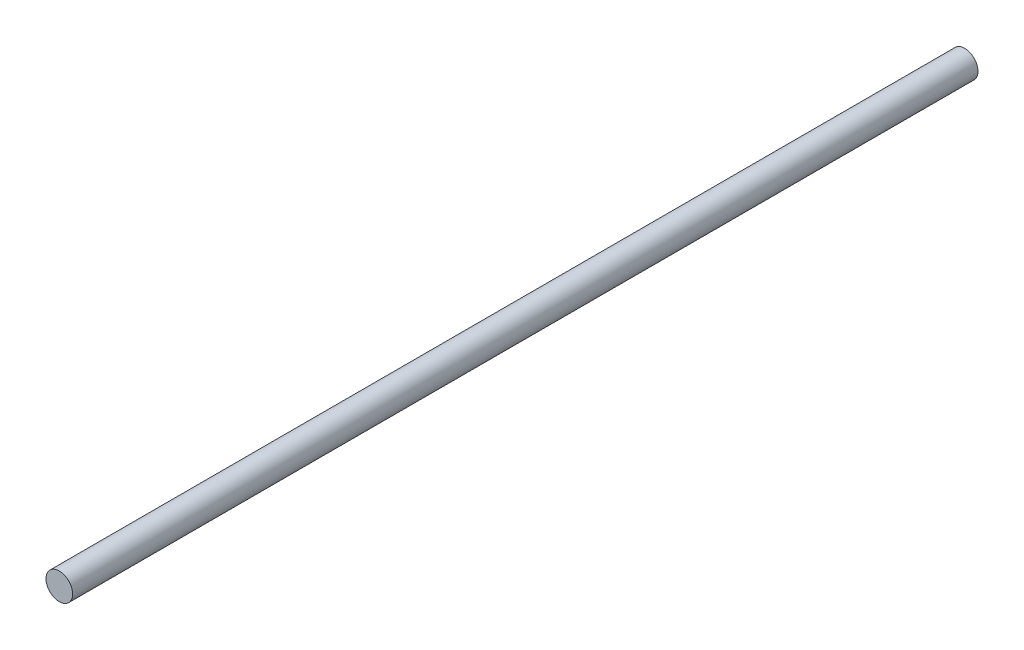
from build123d import *

# Parameters (mm, degrees)
SKETCH2_R           = 2.5
BOSS_EXTRUDE1_DEPTH = 170


with BuildPart() as part:
    # Sketch2 → Boss-Extrude1 (new body)
    with BuildSketch(Plane.XY):
        Circle(SKETCH2_R)
    extrude(amount=BOSS_EXTRUDE1_DEPTH)


solid = part.part
